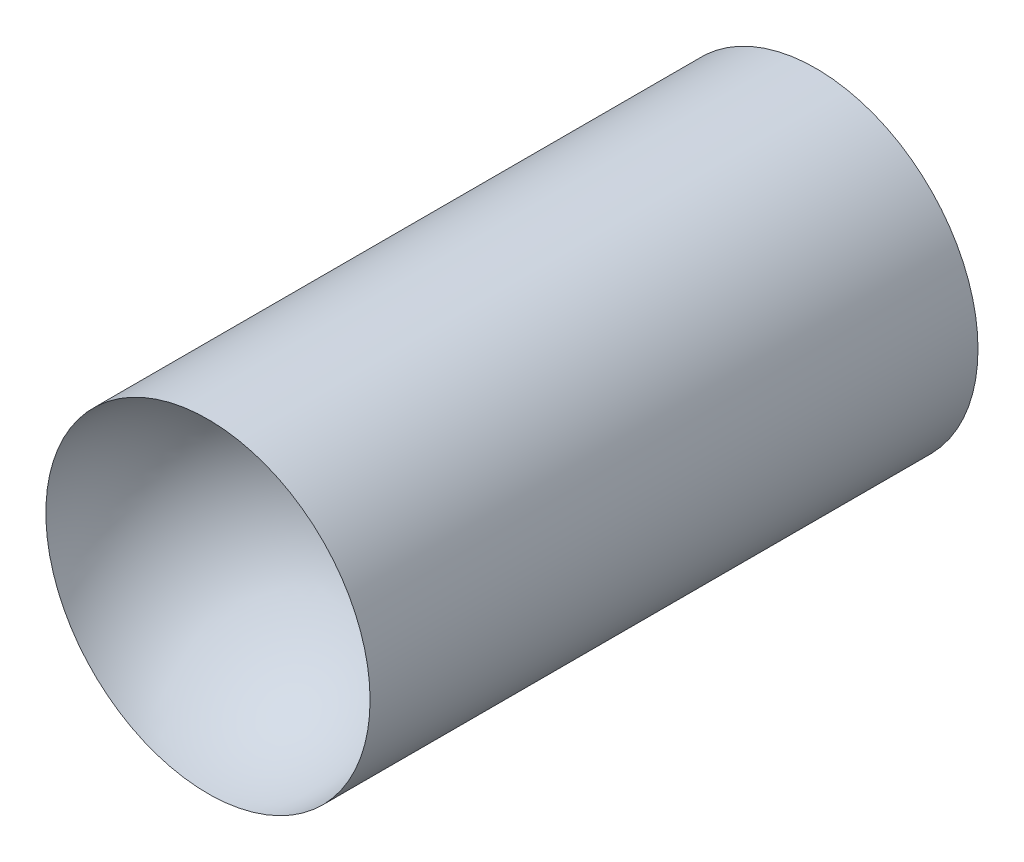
ISO-10303-21;
HEADER;
FILE_DESCRIPTION(('STEP AP214'),'2;1');
FILE_NAME('part.step','',(''),(''),'','','');
FILE_SCHEMA(('AUTOMOTIVE_DESIGN { 1 0 10303 214 1 1 1 1 }'));
ENDSEC;
DATA;
#1=APPLICATION_CONTEXT('core data for automotive mechanical design processes');
#2=APPLICATION_PROTOCOL_DEFINITION('international standard','automotive_design',2000,#1);
#3=PRODUCT_CONTEXT('',#1,'mechanical');
#4=PRODUCT('Part','Part','',(#3));
#5=PRODUCT_RELATED_PRODUCT_CATEGORY('part','',(#4));
#6=PRODUCT_DEFINITION_FORMATION('','',#4);
#7=PRODUCT_DEFINITION_CONTEXT('part definition',#1,'design');
#8=PRODUCT_DEFINITION('design','',#6,#7);
#9=PRODUCT_DEFINITION_SHAPE('','',#8);
#10=(LENGTH_UNIT() NAMED_UNIT(*) SI_UNIT(.MILLI.,.METRE.));
#11=(NAMED_UNIT(*) PLANE_ANGLE_UNIT() SI_UNIT($,.RADIAN.));
#12=(NAMED_UNIT(*) SI_UNIT($,.STERADIAN.) SOLID_ANGLE_UNIT());
#13=UNCERTAINTY_MEASURE_WITH_UNIT(LENGTH_MEASURE(1.E-05),#10,'distance_accuracy_value','');
#14=(GEOMETRIC_REPRESENTATION_CONTEXT(3) GLOBAL_UNCERTAINTY_ASSIGNED_CONTEXT((#13)) GLOBAL_UNIT_ASSIGNED_CONTEXT((#10,
#11,#12)) REPRESENTATION_CONTEXT('',''));
#15=CARTESIAN_POINT('',(0.,0.,0.));
#16=DIRECTION('',(0.,0.,1.));
#17=DIRECTION('',(1.,0.,0.));
#18=AXIS2_PLACEMENT_3D('',#15,#16,#17);
#19=CARTESIAN_POINT('',(0.,0.,15.));
#20=DIRECTION('',(0.,0.,-1.));
#21=DIRECTION('',(-1.,0.,0.));
#22=AXIS2_PLACEMENT_3D('',#19,#20,#21);
#23=CYLINDRICAL_SURFACE('',#22,4.);
#24=CARTESIAN_POINT('',(0.,0.,15.));
#25=DIRECTION('',(0.,0.,1.));
#26=DIRECTION('',(1.,0.,0.));
#27=AXIS2_PLACEMENT_3D('',#24,#25,#26);
#28=CIRCLE('',#27,4.);
#29=CARTESIAN_POINT('',(4.,0.,15.));
#30=VERTEX_POINT('',#29);
#31=EDGE_CURVE('E35',#30,#30,#28,.T.);
#32=ORIENTED_EDGE('',*,*,#31,.F.);
#33=EDGE_LOOP('',(#32));
#34=FACE_BOUND('',#33,.T.);
#35=CARTESIAN_POINT('',(0.,0.,0.));
#36=DIRECTION('',(0.,0.,1.));
#37=DIRECTION('',(1.,0.,0.));
#38=AXIS2_PLACEMENT_3D('',#35,#36,#37);
#39=CIRCLE('',#38,4.);
#40=CARTESIAN_POINT('',(4.,0.,0.));
#41=VERTEX_POINT('',#40);
#42=EDGE_CURVE('E10',#41,#41,#39,.T.);
#43=ORIENTED_EDGE('',*,*,#42,.T.);
#44=EDGE_LOOP('',(#43));
#45=FACE_BOUND('',#44,.T.);
#46=ADVANCED_FACE('F29',(#34,#45),#23,.T.);
#47=CARTESIAN_POINT('',(0.,0.,0.));
#48=DIRECTION('',(0.,0.,1.));
#49=DIRECTION('',(1.,0.,0.));
#50=AXIS2_PLACEMENT_3D('',#47,#48,#49);
#51=PLANE('',#50);
#52=ORIENTED_EDGE('',*,*,#42,.F.);
#53=EDGE_LOOP('',(#52));
#54=FACE_BOUND('',#53,.T.);
#55=ADVANCED_FACE('F44',(#54),#51,.F.);
#56=CARTESIAN_POINT('',(0.,0.,15.));
#57=DIRECTION('',(0.,0.,1.));
#58=DIRECTION('',(1.,0.,0.));
#59=AXIS2_PLACEMENT_3D('',#56,#57,#58);
#60=SPHERICAL_SURFACE('',#59,4.);
#61=ORIENTED_EDGE('',*,*,#31,.T.);
#62=EDGE_LOOP('',(#61));
#63=FACE_BOUND('',#62,.T.);
#64=ADVANCED_FACE('F41',(#63),#60,.F.);
#65=CLOSED_SHELL('',(#46,#55,#64));
#66=MANIFOLD_SOLID_BREP('B2',#65);
#67=ADVANCED_BREP_SHAPE_REPRESENTATION('',(#18,#66),#14);
#68=SHAPE_DEFINITION_REPRESENTATION(#9,#67);
ENDSEC;
END-ISO-10303-21;
